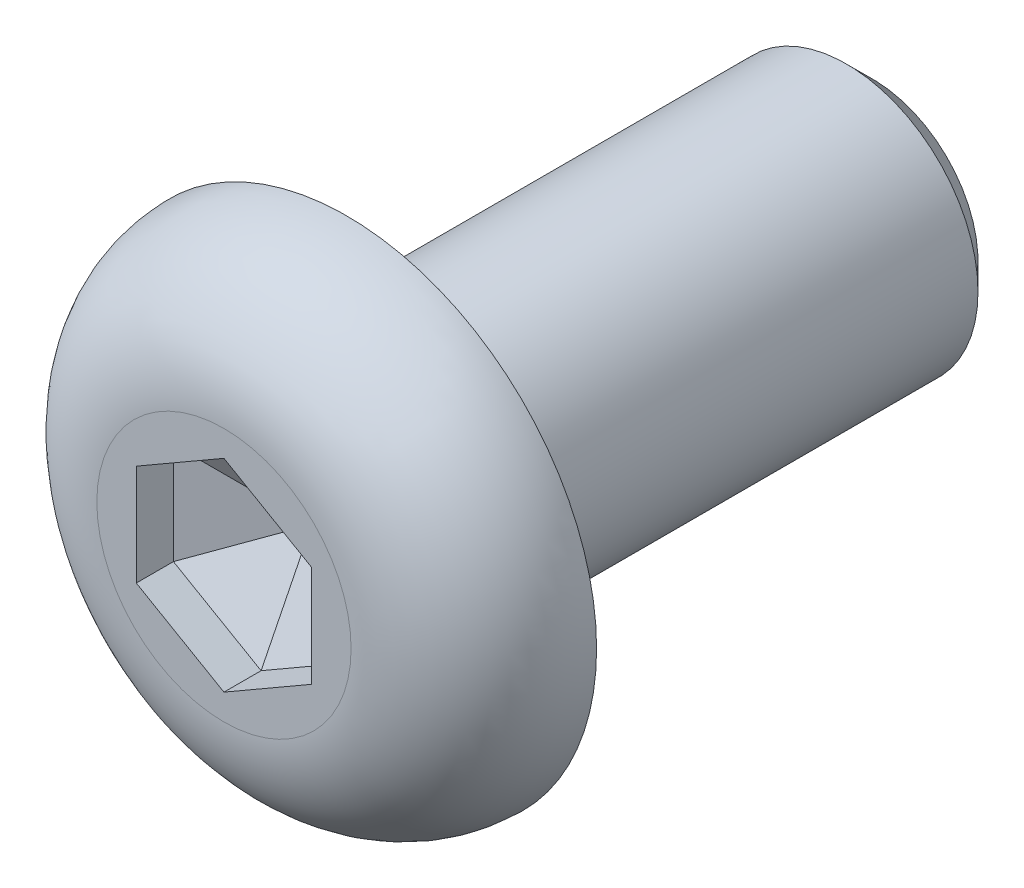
ISO-10303-21;
HEADER;
FILE_DESCRIPTION(('STEP AP214'),'2;1');
FILE_NAME('part.step','',(''),(''),'','','');
FILE_SCHEMA(('AUTOMOTIVE_DESIGN { 1 0 10303 214 1 1 1 1 }'));
ENDSEC;
DATA;
#1=APPLICATION_CONTEXT('core data for automotive mechanical design processes');
#2=APPLICATION_PROTOCOL_DEFINITION('international standard','automotive_design',2000,#1);
#3=PRODUCT_CONTEXT('',#1,'mechanical');
#4=PRODUCT('Part','Part','',(#3));
#5=PRODUCT_RELATED_PRODUCT_CATEGORY('part','',(#4));
#6=PRODUCT_DEFINITION_FORMATION('','',#4);
#7=PRODUCT_DEFINITION_CONTEXT('part definition',#1,'design');
#8=PRODUCT_DEFINITION('design','',#6,#7);
#9=PRODUCT_DEFINITION_SHAPE('','',#8);
#10=(LENGTH_UNIT() NAMED_UNIT(*) SI_UNIT(.MILLI.,.METRE.));
#11=(NAMED_UNIT(*) PLANE_ANGLE_UNIT() SI_UNIT($,.RADIAN.));
#12=(NAMED_UNIT(*) SI_UNIT($,.STERADIAN.) SOLID_ANGLE_UNIT());
#13=UNCERTAINTY_MEASURE_WITH_UNIT(LENGTH_MEASURE(1.E-05),#10,'distance_accuracy_value','');
#14=(GEOMETRIC_REPRESENTATION_CONTEXT(3) GLOBAL_UNCERTAINTY_ASSIGNED_CONTEXT((#13)) GLOBAL_UNIT_ASSIGNED_CONTEXT((#10,
#11,#12)) REPRESENTATION_CONTEXT('',''));
#15=CARTESIAN_POINT('',(0.,0.,0.));
#16=DIRECTION('',(0.,0.,1.));
#17=DIRECTION('',(1.,0.,0.));
#18=AXIS2_PLACEMENT_3D('',#15,#16,#17);
#19=CARTESIAN_POINT('',(0.,0.,0.));
#20=DIRECTION('',(0.,0.,1.));
#21=DIRECTION('',(1.,0.,0.));
#22=AXIS2_PLACEMENT_3D('',#19,#20,#21);
#23=PLANE('',#22);
#24=CARTESIAN_POINT('',(0.,0.,0.));
#25=DIRECTION('',(0.,0.,1.));
#26=DIRECTION('',(1.,0.,0.));
#27=AXIS2_PLACEMENT_3D('',#24,#25,#26);
#28=CIRCLE('',#27,1.6);
#29=CARTESIAN_POINT('',(1.6,0.,0.));
#30=VERTEX_POINT('',#29);
#31=EDGE_CURVE('E11',#30,#30,#28,.T.);
#32=ORIENTED_EDGE('',*,*,#31,.T.);
#33=EDGE_LOOP('',(#32));
#34=FACE_BOUND('',#33,.T.);
#35=CARTESIAN_POINT('',(0.,0.,0.));
#36=DIRECTION('',(0.,0.,1.));
#37=DIRECTION('',(1.,0.,0.));
#38=AXIS2_PLACEMENT_3D('',#35,#36,#37);
#39=CIRCLE('',#38,2.85);
#40=CARTESIAN_POINT('',(2.85,0.,0.));
#41=VERTEX_POINT('',#40);
#42=EDGE_CURVE('E158',#41,#41,#39,.T.);
#43=ORIENTED_EDGE('',*,*,#42,.F.);
#44=EDGE_LOOP('',(#43));
#45=FACE_BOUND('',#44,.T.);
#46=ADVANCED_FACE('F50',(#34,#45),#23,.F.);
#47=CARTESIAN_POINT('',(0.,0.,1.4));
#48=DIRECTION('',(0.,0.,1.));
#49=DIRECTION('',(1.,0.,0.));
#50=AXIS2_PLACEMENT_3D('',#47,#48,#49);
#51=PLANE('',#50);
#52=DIRECTION('',(0.,1.,0.));
#53=VECTOR('',#52,1.);
#54=CARTESIAN_POINT('',(1.,-0.577350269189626,1.4));
#55=LINE('',#54,#53);
#56=CARTESIAN_POINT('',(1.,-0.577350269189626,1.4));
#57=VERTEX_POINT('',#56);
#58=CARTESIAN_POINT('',(1.,0.577350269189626,1.4));
#59=VERTEX_POINT('',#58);
#60=EDGE_CURVE('E139',#57,#59,#55,.T.);
#61=ORIENTED_EDGE('',*,*,#60,.F.);
#62=DIRECTION('',(0.866025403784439,0.5,0.));
#63=VECTOR('',#62,1.);
#64=CARTESIAN_POINT('',(0.,-1.15470053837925,1.4));
#65=LINE('',#64,#63);
#66=CARTESIAN_POINT('',(0.,-1.15470053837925,1.4));
#67=VERTEX_POINT('',#66);
#68=EDGE_CURVE('E153',#67,#57,#65,.T.);
#69=ORIENTED_EDGE('',*,*,#68,.F.);
#70=DIRECTION('',(0.866025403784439,-0.5,0.));
#71=VECTOR('',#70,1.);
#72=CARTESIAN_POINT('',(-1.,-0.577350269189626,1.4));
#73=LINE('',#72,#71);
#74=CARTESIAN_POINT('',(-1.,-0.577350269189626,1.4));
#75=VERTEX_POINT('',#74);
#76=EDGE_CURVE('E147',#75,#67,#73,.T.);
#77=ORIENTED_EDGE('',*,*,#76,.F.);
#78=DIRECTION('',(0.,-1.,0.));
#79=VECTOR('',#78,1.);
#80=CARTESIAN_POINT('',(-1.,0.577350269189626,1.4));
#81=LINE('',#80,#79);
#82=CARTESIAN_POINT('',(-1.,0.577350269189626,1.4));
#83=VERTEX_POINT('',#82);
#84=EDGE_CURVE('E145',#83,#75,#81,.T.);
#85=ORIENTED_EDGE('',*,*,#84,.F.);
#86=DIRECTION('',(-0.866025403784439,-0.5,0.));
#87=VECTOR('',#86,1.);
#88=CARTESIAN_POINT('',(0.,1.15470053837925,1.4));
#89=LINE('',#88,#87);
#90=CARTESIAN_POINT('',(0.,1.15470053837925,1.4));
#91=VERTEX_POINT('',#90);
#92=EDGE_CURVE('E126',#91,#83,#89,.T.);
#93=ORIENTED_EDGE('',*,*,#92,.F.);
#94=DIRECTION('',(-0.866025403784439,0.5,0.));
#95=VECTOR('',#94,1.);
#96=CARTESIAN_POINT('',(1.,0.577350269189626,1.4));
#97=LINE('',#96,#95);
#98=EDGE_CURVE('E134',#59,#91,#97,.T.);
#99=ORIENTED_EDGE('',*,*,#98,.F.);
#100=EDGE_LOOP('',(#61,#69,#77,#85,#93,#99));
#101=FACE_BOUND('',#100,.T.);
#102=CARTESIAN_POINT('',(0.,0.,1.4));
#103=DIRECTION('',(0.,0.,1.));
#104=DIRECTION('',(1.,0.,0.));
#105=AXIS2_PLACEMENT_3D('',#102,#103,#104);
#106=CIRCLE('',#105,1.45);
#107=CARTESIAN_POINT('',(1.45,0.,1.4));
#108=VERTEX_POINT('',#107);
#109=EDGE_CURVE('E167',#108,#108,#106,.T.);
#110=ORIENTED_EDGE('',*,*,#109,.T.);
#111=EDGE_LOOP('',(#110));
#112=FACE_BOUND('',#111,.T.);
#113=ADVANCED_FACE('F141',(#101,#112),#51,.T.);
#114=CARTESIAN_POINT('',(0.,0.,0.));
#115=DIRECTION('',(0.,0.,1.));
#116=DIRECTION('',(1.,0.,0.));
#117=AXIS2_PLACEMENT_3D('',#114,#115,#116);
#118=TOROIDAL_SURFACE('',#117,1.45,1.4);
#119=ORIENTED_EDGE('',*,*,#42,.T.);
#120=EDGE_LOOP('',(#119));
#121=FACE_BOUND('',#120,.T.);
#122=ORIENTED_EDGE('',*,*,#109,.F.);
#123=EDGE_LOOP('',(#122));
#124=FACE_BOUND('',#123,.T.);
#125=ADVANCED_FACE('F237',(#121,#124),#118,.T.);
#126=CARTESIAN_POINT('',(0.,0.,-6.));
#127=DIRECTION('',(0.,0.,1.));
#128=DIRECTION('',(1.,0.,0.));
#129=AXIS2_PLACEMENT_3D('',#126,#127,#128);
#130=CYLINDRICAL_SURFACE('',#129,1.5);
#131=CARTESIAN_POINT('',(0.,0.,-0.1));
#132=DIRECTION('',(0.,0.,1.));
#133=DIRECTION('',(1.,0.,0.));
#134=AXIS2_PLACEMENT_3D('',#131,#132,#133);
#135=CIRCLE('',#134,1.5);
#136=CARTESIAN_POINT('',(1.5,0.,-0.1));
#137=VERTEX_POINT('',#136);
#138=EDGE_CURVE('E58',#137,#137,#135,.F.);
#139=ORIENTED_EDGE('',*,*,#138,.T.);
#140=EDGE_LOOP('',(#139));
#141=FACE_BOUND('',#140,.T.);
#142=CARTESIAN_POINT('',(0.,0.,-5.7));
#143=DIRECTION('',(0.,0.,-1.));
#144=DIRECTION('',(-1.,0.,0.));
#145=AXIS2_PLACEMENT_3D('',#142,#143,#144);
#146=CIRCLE('',#145,1.5);
#147=CARTESIAN_POINT('',(-1.5,0.,-5.7));
#148=VERTEX_POINT('',#147);
#149=EDGE_CURVE('E173',#148,#148,#146,.F.);
#150=ORIENTED_EDGE('',*,*,#149,.T.);
#151=EDGE_LOOP('',(#150));
#152=FACE_BOUND('',#151,.T.);
#153=ADVANCED_FACE('F217',(#141,#152),#130,.T.);
#154=CARTESIAN_POINT('',(0.,0.,-6.));
#155=DIRECTION('',(0.,0.,-1.));
#156=DIRECTION('',(-1.,0.,0.));
#157=AXIS2_PLACEMENT_3D('',#154,#155,#156);
#158=PLANE('',#157);
#159=CARTESIAN_POINT('',(0.,0.,-6.));
#160=DIRECTION('',(0.,0.,-1.));
#161=DIRECTION('',(-1.,0.,0.));
#162=AXIS2_PLACEMENT_3D('',#159,#160,#161);
#163=CIRCLE('',#162,1.2);
#164=CARTESIAN_POINT('',(-1.2,0.,-6.));
#165=VERTEX_POINT('',#164);
#166=EDGE_CURVE('E170',#165,#165,#163,.T.);
#167=ORIENTED_EDGE('',*,*,#166,.T.);
#168=EDGE_LOOP('',(#167));
#169=FACE_BOUND('',#168,.T.);
#170=ADVANCED_FACE('F312',(#169),#158,.T.);
#171=CARTESIAN_POINT('',(1.,-0.577350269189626,0.4));
#172=DIRECTION('',(1.,0.,0.));
#173=DIRECTION('',(0.,0.,-1.));
#174=AXIS2_PLACEMENT_3D('',#171,#172,#173);
#175=PLANE('',#174);
#176=DIRECTION('',(0.,0.,1.));
#177=VECTOR('',#176,1.);
#178=CARTESIAN_POINT('',(1.,0.577350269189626,0.4));
#179=LINE('',#178,#177);
#180=CARTESIAN_POINT('',(1.,0.577350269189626,0.97636887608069));
#181=VERTEX_POINT('',#180);
#182=EDGE_CURVE('E131',#181,#59,#179,.T.);
#183=ORIENTED_EDGE('',*,*,#182,.F.);
#184=DIRECTION('',(0.,-1.,0.));
#185=VECTOR('',#184,1.);
#186=CARTESIAN_POINT('',(1.,-0.577350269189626,0.97636887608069));
#187=LINE('',#186,#185);
#188=CARTESIAN_POINT('',(1.,-0.577350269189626,0.97636887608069));
#189=VERTEX_POINT('',#188);
#190=EDGE_CURVE('E65',#181,#189,#187,.T.);
#191=ORIENTED_EDGE('',*,*,#190,.T.);
#192=DIRECTION('',(0.,0.,1.));
#193=VECTOR('',#192,1.);
#194=CARTESIAN_POINT('',(1.,-0.577350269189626,0.4));
#195=LINE('',#194,#193);
#196=EDGE_CURVE('E156',#189,#57,#195,.T.);
#197=ORIENTED_EDGE('',*,*,#196,.T.);
#198=ORIENTED_EDGE('',*,*,#60,.T.);
#199=EDGE_LOOP('',(#183,#191,#197,#198));
#200=FACE_BOUND('',#199,.T.);
#201=ADVANCED_FACE('F303',(#200),#175,.F.);
#202=CARTESIAN_POINT('',(0.,-1.15470053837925,0.4));
#203=DIRECTION('',(0.5,-0.866025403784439,0.));
#204=DIRECTION('',(0.866025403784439,0.5,0.));
#205=AXIS2_PLACEMENT_3D('',#202,#203,#204);
#206=PLANE('',#205);
#207=ORIENTED_EDGE('',*,*,#196,.F.);
#208=DIRECTION('',(-0.866025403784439,-0.5,0.));
#209=VECTOR('',#208,1.);
#210=CARTESIAN_POINT('',(0.,-1.15470053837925,0.976368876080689));
#211=LINE('',#210,#209);
#212=CARTESIAN_POINT('',(0.,-1.15470053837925,0.976368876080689));
#213=VERTEX_POINT('',#212);
#214=EDGE_CURVE('E196',#189,#213,#211,.T.);
#215=ORIENTED_EDGE('',*,*,#214,.T.);
#216=DIRECTION('',(0.,0.,1.));
#217=VECTOR('',#216,1.);
#218=CARTESIAN_POINT('',(0.,-1.15470053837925,0.4));
#219=LINE('',#218,#217);
#220=EDGE_CURVE('E159',#213,#67,#219,.T.);
#221=ORIENTED_EDGE('',*,*,#220,.T.);
#222=ORIENTED_EDGE('',*,*,#68,.T.);
#223=EDGE_LOOP('',(#207,#215,#221,#222));
#224=FACE_BOUND('',#223,.T.);
#225=ADVANCED_FACE('F280',(#224),#206,.F.);
#226=CARTESIAN_POINT('',(-1.,-0.577350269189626,0.4));
#227=DIRECTION('',(-0.5,-0.866025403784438,0.));
#228=DIRECTION('',(0.866025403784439,-0.5,0.));
#229=AXIS2_PLACEMENT_3D('',#226,#227,#228);
#230=PLANE('',#229);
#231=ORIENTED_EDGE('',*,*,#220,.F.);
#232=DIRECTION('',(-0.866025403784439,0.5,0.));
#233=VECTOR('',#232,1.);
#234=CARTESIAN_POINT('',(-1.,-0.577350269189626,0.97636887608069));
#235=LINE('',#234,#233);
#236=CARTESIAN_POINT('',(-1.,-0.577350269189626,0.97636887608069));
#237=VERTEX_POINT('',#236);
#238=EDGE_CURVE('E189',#213,#237,#235,.T.);
#239=ORIENTED_EDGE('',*,*,#238,.T.);
#240=DIRECTION('',(0.,0.,1.));
#241=VECTOR('',#240,1.);
#242=CARTESIAN_POINT('',(-1.,-0.577350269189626,0.4));
#243=LINE('',#242,#241);
#244=EDGE_CURVE('E161',#237,#75,#243,.T.);
#245=ORIENTED_EDGE('',*,*,#244,.T.);
#246=ORIENTED_EDGE('',*,*,#76,.T.);
#247=EDGE_LOOP('',(#231,#239,#245,#246));
#248=FACE_BOUND('',#247,.T.);
#249=ADVANCED_FACE('F283',(#248),#230,.F.);
#250=CARTESIAN_POINT('',(-1.,0.577350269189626,0.4));
#251=DIRECTION('',(-1.,0.,0.));
#252=DIRECTION('',(0.,0.,1.));
#253=AXIS2_PLACEMENT_3D('',#250,#251,#252);
#254=PLANE('',#253);
#255=ORIENTED_EDGE('',*,*,#244,.F.);
#256=DIRECTION('',(0.,1.,0.));
#257=VECTOR('',#256,1.);
#258=CARTESIAN_POINT('',(-1.,0.577350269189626,0.97636887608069));
#259=LINE('',#258,#257);
#260=CARTESIAN_POINT('',(-1.,0.577350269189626,0.976368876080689));
#261=VERTEX_POINT('',#260);
#262=EDGE_CURVE('E192',#237,#261,#259,.T.);
#263=ORIENTED_EDGE('',*,*,#262,.T.);
#264=DIRECTION('',(0.,0.,1.));
#265=VECTOR('',#264,1.);
#266=CARTESIAN_POINT('',(-1.,0.577350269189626,0.4));
#267=LINE('',#266,#265);
#268=EDGE_CURVE('E130',#261,#83,#267,.T.);
#269=ORIENTED_EDGE('',*,*,#268,.T.);
#270=ORIENTED_EDGE('',*,*,#84,.T.);
#271=EDGE_LOOP('',(#255,#263,#269,#270));
#272=FACE_BOUND('',#271,.T.);
#273=ADVANCED_FACE('F292',(#272),#254,.F.);
#274=CARTESIAN_POINT('',(0.,1.15470053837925,0.4));
#275=DIRECTION('',(-0.5,0.866025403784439,0.));
#276=DIRECTION('',(-0.866025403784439,-0.5,0.));
#277=AXIS2_PLACEMENT_3D('',#274,#275,#276);
#278=PLANE('',#277);
#279=ORIENTED_EDGE('',*,*,#268,.F.);
#280=DIRECTION('',(0.866025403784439,0.5,0.));
#281=VECTOR('',#280,1.);
#282=CARTESIAN_POINT('',(0.,1.15470053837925,0.976368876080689));
#283=LINE('',#282,#281);
#284=CARTESIAN_POINT('',(0.,1.15470053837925,0.97636887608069));
#285=VERTEX_POINT('',#284);
#286=EDGE_CURVE('E129',#261,#285,#283,.T.);
#287=ORIENTED_EDGE('',*,*,#286,.T.);
#288=DIRECTION('',(0.,0.,1.));
#289=VECTOR('',#288,1.);
#290=CARTESIAN_POINT('',(0.,1.15470053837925,0.4));
#291=LINE('',#290,#289);
#292=EDGE_CURVE('E121',#285,#91,#291,.T.);
#293=ORIENTED_EDGE('',*,*,#292,.T.);
#294=ORIENTED_EDGE('',*,*,#92,.T.);
#295=EDGE_LOOP('',(#279,#287,#293,#294));
#296=FACE_BOUND('',#295,.T.);
#297=ADVANCED_FACE('F124',(#296),#278,.F.);
#298=CARTESIAN_POINT('',(1.,0.577350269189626,0.4));
#299=DIRECTION('',(0.5,0.866025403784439,0.));
#300=DIRECTION('',(-0.866025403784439,0.5,0.));
#301=AXIS2_PLACEMENT_3D('',#298,#299,#300);
#302=PLANE('',#301);
#303=ORIENTED_EDGE('',*,*,#292,.F.);
#304=DIRECTION('',(0.866025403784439,-0.5,0.));
#305=VECTOR('',#304,1.);
#306=CARTESIAN_POINT('',(1.,0.577350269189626,0.97636887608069));
#307=LINE('',#306,#305);
#308=EDGE_CURVE('E73',#285,#181,#307,.T.);
#309=ORIENTED_EDGE('',*,*,#308,.T.);
#310=ORIENTED_EDGE('',*,*,#182,.T.);
#311=ORIENTED_EDGE('',*,*,#98,.T.);
#312=EDGE_LOOP('',(#303,#309,#310,#311));
#313=FACE_BOUND('',#312,.T.);
#314=ADVANCED_FACE('F135',(#313),#302,.F.);
#315=CARTESIAN_POINT('',(0.,0.,0.4));
#316=DIRECTION('',(0.,0.,1.));
#317=DIRECTION('',(1.,0.,0.));
#318=AXIS2_PLACEMENT_3D('',#315,#316,#317);
#319=PLANE('',#318);
#320=DIRECTION('',(0.,-1.,0.));
#321=VECTOR('',#320,1.);
#322=CARTESIAN_POINT('',(-0.00169982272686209,0.,0.4));
#323=LINE('',#322,#321);
#324=CARTESIAN_POINT('',(-0.00169982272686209,0.000981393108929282,0.4));
#325=VERTEX_POINT('',#324);
#326=CARTESIAN_POINT('',(-0.00169982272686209,-0.000981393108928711,0.4));
#327=VERTEX_POINT('',#326);
#328=EDGE_CURVE('E184',#325,#327,#323,.T.);
#329=ORIENTED_EDGE('',*,*,#328,.T.);
#330=DIRECTION('',(0.866025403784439,-0.5,0.));
#331=VECTOR('',#330,1.);
#332=CARTESIAN_POINT('',(-0.000849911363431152,-0.00147208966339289,0.4));
#333=LINE('',#332,#331);
#334=CARTESIAN_POINT('',(0.,-0.00196278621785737,0.4));
#335=VERTEX_POINT('',#334);
#336=EDGE_CURVE('E186',#327,#335,#333,.T.);
#337=ORIENTED_EDGE('',*,*,#336,.T.);
#338=DIRECTION('',(0.866025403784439,0.5,0.));
#339=VECTOR('',#338,1.);
#340=CARTESIAN_POINT('',(0.000849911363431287,-0.00147208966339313,0.4));
#341=LINE('',#340,#339);
#342=CARTESIAN_POINT('',(0.0016998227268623,-0.000981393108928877,0.4));
#343=VERTEX_POINT('',#342);
#344=EDGE_CURVE('E178',#335,#343,#341,.T.);
#345=ORIENTED_EDGE('',*,*,#344,.T.);
#346=DIRECTION('',(0.,1.,0.));
#347=VECTOR('',#346,1.);
#348=CARTESIAN_POINT('',(0.0016998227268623,0.,0.4));
#349=LINE('',#348,#347);
#350=CARTESIAN_POINT('',(0.0016998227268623,0.000981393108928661,0.4));
#351=VERTEX_POINT('',#350);
#352=EDGE_CURVE('E176',#343,#351,#349,.T.);
#353=ORIENTED_EDGE('',*,*,#352,.T.);
#354=DIRECTION('',(-0.866025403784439,0.5,0.));
#355=VECTOR('',#354,1.);
#356=CARTESIAN_POINT('',(0.000849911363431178,0.00147208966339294,0.4));
#357=LINE('',#356,#355);
#358=CARTESIAN_POINT('',(0.,0.00196278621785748,0.4));
#359=VERTEX_POINT('',#358);
#360=EDGE_CURVE('E180',#351,#359,#357,.T.);
#361=ORIENTED_EDGE('',*,*,#360,.T.);
#362=DIRECTION('',(-0.866025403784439,-0.5,0.));
#363=VECTOR('',#362,1.);
#364=CARTESIAN_POINT('',(-0.000849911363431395,0.00147208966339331,0.4));
#365=LINE('',#364,#363);
#366=EDGE_CURVE('E182',#359,#325,#365,.T.);
#367=ORIENTED_EDGE('',*,*,#366,.T.);
#368=EDGE_LOOP('',(#329,#337,#345,#353,#361,#367));
#369=FACE_BOUND('',#368,.T.);
#370=ADVANCED_FACE('F248',(#369),#319,.T.);
#371=CARTESIAN_POINT('',(0.,0.,-6.));
#372=DIRECTION('',(0.,0.,1.));
#373=DIRECTION('',(1.,0.,0.));
#374=AXIS2_PLACEMENT_3D('',#371,#372,#373);
#375=CONICAL_SURFACE('',#374,1.2,0.785398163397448);
#376=ORIENTED_EDGE('',*,*,#149,.F.);
#377=EDGE_LOOP('',(#376));
#378=FACE_BOUND('',#377,.T.);
#379=ORIENTED_EDGE('',*,*,#166,.F.);
#380=EDGE_LOOP('',(#379));
#381=FACE_BOUND('',#380,.T.);
#382=ADVANCED_FACE('F245',(#378,#381),#375,.T.);
#383=CARTESIAN_POINT('',(0.000849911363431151,0.00147208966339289,0.4));
#384=DIRECTION('',(0.249999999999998,0.433012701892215,-0.866025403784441));
#385=DIRECTION('',(-0.866025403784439,0.5,0.));
#386=AXIS2_PLACEMENT_3D('',#383,#384,#385);
#387=PLANE('',#386);
#388=DIRECTION('',(-0.774596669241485,-0.447213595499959,-0.447213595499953));
#389=VECTOR('',#388,1.);
#390=CARTESIAN_POINT('',(0.00135985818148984,0.000785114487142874,0.399803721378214));
#391=LINE('',#390,#389);
#392=EDGE_CURVE('E209',#181,#351,#391,.T.);
#393=ORIENTED_EDGE('',*,*,#392,.F.);
#394=ORIENTED_EDGE('',*,*,#308,.F.);
#395=DIRECTION('',(0.,-0.894427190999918,-0.447213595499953));
#396=VECTOR('',#395,1.);
#397=CARTESIAN_POINT('',(0.,0.00157022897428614,0.399803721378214));
#398=LINE('',#397,#396);
#399=EDGE_CURVE('E212',#359,#285,#398,.F.);
#400=ORIENTED_EDGE('',*,*,#399,.F.);
#401=ORIENTED_EDGE('',*,*,#360,.F.);
#402=EDGE_LOOP('',(#393,#394,#400,#401));
#403=FACE_BOUND('',#402,.T.);
#404=ADVANCED_FACE('F247',(#403),#387,.F.);
#405=CARTESIAN_POINT('',(-0.000849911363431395,0.00147208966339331,0.4));
#406=DIRECTION('',(-0.249999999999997,0.433012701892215,-0.866025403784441));
#407=DIRECTION('',(-0.866025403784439,-0.5,0.));
#408=AXIS2_PLACEMENT_3D('',#405,#406,#407);
#409=PLANE('',#408);
#410=ORIENTED_EDGE('',*,*,#399,.T.);
#411=ORIENTED_EDGE('',*,*,#286,.F.);
#412=DIRECTION('',(0.774596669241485,-0.447213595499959,-0.447213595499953));
#413=VECTOR('',#412,1.);
#414=CARTESIAN_POINT('',(-0.00135985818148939,0.000785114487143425,0.399803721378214));
#415=LINE('',#414,#413);
#416=EDGE_CURVE('E206',#325,#261,#415,.F.);
#417=ORIENTED_EDGE('',*,*,#416,.F.);
#418=ORIENTED_EDGE('',*,*,#366,.F.);
#419=EDGE_LOOP('',(#410,#411,#417,#418));
#420=FACE_BOUND('',#419,.T.);
#421=ADVANCED_FACE('F261',(#420),#409,.F.);
#422=CARTESIAN_POINT('',(0.0016998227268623,0.,0.4));
#423=DIRECTION('',(0.499999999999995,0.,-0.866025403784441));
#424=DIRECTION('',(0.,1.,0.));
#425=AXIS2_PLACEMENT_3D('',#422,#423,#424);
#426=PLANE('',#425);
#427=ORIENTED_EDGE('',*,*,#392,.T.);
#428=ORIENTED_EDGE('',*,*,#352,.F.);
#429=DIRECTION('',(0.774596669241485,-0.447213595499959,0.447213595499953));
#430=VECTOR('',#429,1.);
#431=CARTESIAN_POINT('',(0.00135985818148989,-0.000785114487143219,0.399803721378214));
#432=LINE('',#431,#430);
#433=EDGE_CURVE('E203',#189,#343,#432,.F.);
#434=ORIENTED_EDGE('',*,*,#433,.F.);
#435=ORIENTED_EDGE('',*,*,#190,.F.);
#436=EDGE_LOOP('',(#427,#428,#434,#435));
#437=FACE_BOUND('',#436,.T.);
#438=ADVANCED_FACE('F257',(#437),#426,.F.);
#439=CARTESIAN_POINT('',(-0.00169982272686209,0.,0.4));
#440=DIRECTION('',(-0.499999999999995,0.,-0.866025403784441));
#441=DIRECTION('',(0.,-1.,0.));
#442=AXIS2_PLACEMENT_3D('',#439,#440,#441);
#443=PLANE('',#442);
#444=ORIENTED_EDGE('',*,*,#416,.T.);
#445=ORIENTED_EDGE('',*,*,#262,.F.);
#446=DIRECTION('',(0.774596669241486,0.447213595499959,-0.447213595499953));
#447=VECTOR('',#446,1.);
#448=CARTESIAN_POINT('',(-0.00135985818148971,-0.00078511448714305,0.399803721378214));
#449=LINE('',#448,#447);
#450=EDGE_CURVE('E201',#327,#237,#449,.F.);
#451=ORIENTED_EDGE('',*,*,#450,.F.);
#452=ORIENTED_EDGE('',*,*,#328,.F.);
#453=EDGE_LOOP('',(#444,#445,#451,#452));
#454=FACE_BOUND('',#453,.T.);
#455=ADVANCED_FACE('F253',(#454),#443,.F.);
#456=CARTESIAN_POINT('',(0.000849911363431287,-0.00147208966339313,0.4));
#457=DIRECTION('',(0.249999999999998,-0.433012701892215,-0.866025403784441));
#458=DIRECTION('',(0.866025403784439,0.5,0.));
#459=AXIS2_PLACEMENT_3D('',#456,#457,#458);
#460=PLANE('',#459);
#461=ORIENTED_EDGE('',*,*,#433,.T.);
#462=ORIENTED_EDGE('',*,*,#344,.F.);
#463=DIRECTION('',(0.,-0.894427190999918,0.447213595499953));
#464=VECTOR('',#463,1.);
#465=CARTESIAN_POINT('',(0.,-0.00157022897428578,0.399803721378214));
#466=LINE('',#465,#464);
#467=EDGE_CURVE('E199',#213,#335,#466,.F.);
#468=ORIENTED_EDGE('',*,*,#467,.F.);
#469=ORIENTED_EDGE('',*,*,#214,.F.);
#470=EDGE_LOOP('',(#461,#462,#468,#469));
#471=FACE_BOUND('',#470,.T.);
#472=ADVANCED_FACE('F227',(#471),#460,.F.);
#473=CARTESIAN_POINT('',(-0.000849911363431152,-0.00147208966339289,0.4));
#474=DIRECTION('',(-0.249999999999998,-0.433012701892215,-0.866025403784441));
#475=DIRECTION('',(0.866025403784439,-0.5,0.));
#476=AXIS2_PLACEMENT_3D('',#473,#474,#475);
#477=PLANE('',#476);
#478=ORIENTED_EDGE('',*,*,#450,.T.);
#479=ORIENTED_EDGE('',*,*,#238,.F.);
#480=ORIENTED_EDGE('',*,*,#467,.T.);
#481=ORIENTED_EDGE('',*,*,#336,.F.);
#482=EDGE_LOOP('',(#478,#479,#480,#481));
#483=FACE_BOUND('',#482,.T.);
#484=ADVANCED_FACE('F221',(#483),#477,.F.);
#485=CARTESIAN_POINT('',(0.,0.,-0.1));
#486=DIRECTION('',(0.,0.,1.));
#487=DIRECTION('',(1.,0.,0.));
#488=AXIS2_PLACEMENT_3D('',#485,#486,#487);
#489=TOROIDAL_SURFACE('',#488,1.6,0.1);
#490=ORIENTED_EDGE('',*,*,#31,.F.);
#491=EDGE_LOOP('',(#490));
#492=FACE_BOUND('',#491,.T.);
#493=ORIENTED_EDGE('',*,*,#138,.F.);
#494=EDGE_LOOP('',(#493));
#495=FACE_BOUND('',#494,.T.);
#496=ADVANCED_FACE('F52',(#492,#495),#489,.F.);
#497=CLOSED_SHELL('',(#46,#113,#125,#153,#170,#201,#225,#249,#273,#297,#314,#370,#382,#404,#421,
#438,#455,#472,#484,#496));
#498=MANIFOLD_SOLID_BREP('B2',#497);
#499=ADVANCED_BREP_SHAPE_REPRESENTATION('',(#18,#498),#14);
#500=SHAPE_DEFINITION_REPRESENTATION(#9,#499);
ENDSEC;
END-ISO-10303-21;
